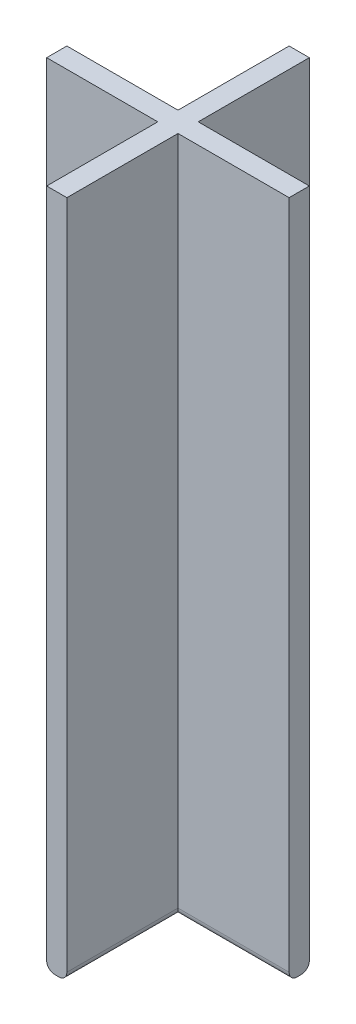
ISO-10303-21;
HEADER;
FILE_DESCRIPTION(('STEP AP214'),'2;1');
FILE_NAME('part.step','',(''),(''),'','','');
FILE_SCHEMA(('AUTOMOTIVE_DESIGN { 1 0 10303 214 1 1 1 1 }'));
ENDSEC;
DATA;
#1=APPLICATION_CONTEXT('core data for automotive mechanical design processes');
#2=APPLICATION_PROTOCOL_DEFINITION('international standard','automotive_design',2000,#1);
#3=PRODUCT_CONTEXT('',#1,'mechanical');
#4=PRODUCT('Part','Part','',(#3));
#5=PRODUCT_RELATED_PRODUCT_CATEGORY('part','',(#4));
#6=PRODUCT_DEFINITION_FORMATION('','',#4);
#7=PRODUCT_DEFINITION_CONTEXT('part definition',#1,'design');
#8=PRODUCT_DEFINITION('design','',#6,#7);
#9=PRODUCT_DEFINITION_SHAPE('','',#8);
#10=(LENGTH_UNIT() NAMED_UNIT(*) SI_UNIT(.MILLI.,.METRE.));
#11=(NAMED_UNIT(*) PLANE_ANGLE_UNIT() SI_UNIT($,.RADIAN.));
#12=(NAMED_UNIT(*) SI_UNIT($,.STERADIAN.) SOLID_ANGLE_UNIT());
#13=UNCERTAINTY_MEASURE_WITH_UNIT(LENGTH_MEASURE(1.E-05),#10,'distance_accuracy_value','');
#14=(GEOMETRIC_REPRESENTATION_CONTEXT(3) GLOBAL_UNCERTAINTY_ASSIGNED_CONTEXT((#13)) GLOBAL_UNIT_ASSIGNED_CONTEXT((#10,
#11,#12)) REPRESENTATION_CONTEXT('',''));
#15=CARTESIAN_POINT('',(0.,0.,0.));
#16=DIRECTION('',(0.,0.,1.));
#17=DIRECTION('',(1.,0.,0.));
#18=AXIS2_PLACEMENT_3D('',#15,#16,#17);
#19=CARTESIAN_POINT('',(-15.,84.,1.25));
#20=DIRECTION('',(0.,0.,-1.));
#21=DIRECTION('',(-1.,0.,0.));
#22=AXIS2_PLACEMENT_3D('',#19,#20,#21);
#23=PLANE('',#22);
#24=DIRECTION('',(0.,-1.,0.));
#25=VECTOR('',#24,1.);
#26=CARTESIAN_POINT('',(-15.,84.,1.25));
#27=LINE('',#26,#25);
#28=CARTESIAN_POINT('',(-15.,84.,1.25));
#29=VERTEX_POINT('',#28);
#30=CARTESIAN_POINT('',(-15.,1.00000000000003,1.25));
#31=VERTEX_POINT('',#30);
#32=EDGE_CURVE('E277',#29,#31,#27,.T.);
#33=ORIENTED_EDGE('',*,*,#32,.T.);
#34=DIRECTION('',(1.,0.,0.));
#35=VECTOR('',#34,1.);
#36=CARTESIAN_POINT('',(-1.25,1.,1.25));
#37=LINE('',#36,#35);
#38=CARTESIAN_POINT('',(-1.25,1.,1.25));
#39=VERTEX_POINT('',#38);
#40=EDGE_CURVE('E11',#31,#39,#37,.T.);
#41=ORIENTED_EDGE('',*,*,#40,.T.);
#42=DIRECTION('',(0.,-1.,0.));
#43=VECTOR('',#42,1.);
#44=CARTESIAN_POINT('',(-1.25,84.,1.25));
#45=LINE('',#44,#43);
#46=CARTESIAN_POINT('',(-1.25,84.,1.25));
#47=VERTEX_POINT('',#46);
#48=EDGE_CURVE('E265',#47,#39,#45,.T.);
#49=ORIENTED_EDGE('',*,*,#48,.F.);
#50=DIRECTION('',(1.,0.,0.));
#51=VECTOR('',#50,1.);
#52=CARTESIAN_POINT('',(-15.,84.,1.25));
#53=LINE('',#52,#51);
#54=EDGE_CURVE('E182',#29,#47,#53,.T.);
#55=ORIENTED_EDGE('',*,*,#54,.F.);
#56=EDGE_LOOP('',(#33,#41,#49,#55));
#57=FACE_BOUND('',#56,.T.);
#58=ADVANCED_FACE('F43',(#57),#23,.F.);
#59=CARTESIAN_POINT('',(0.,84.,-1.25));
#60=DIRECTION('',(0.,0.,1.));
#61=DIRECTION('',(1.,0.,0.));
#62=AXIS2_PLACEMENT_3D('',#59,#60,#61);
#63=PLANE('',#62);
#64=DIRECTION('',(0.,1.,0.));
#65=VECTOR('',#64,1.);
#66=CARTESIAN_POINT('',(-1.25,84.,-1.25));
#67=LINE('',#66,#65);
#68=CARTESIAN_POINT('',(-1.25,1.,-1.25));
#69=VERTEX_POINT('',#68);
#70=CARTESIAN_POINT('',(-1.25,84.,-1.25));
#71=VERTEX_POINT('',#70);
#72=EDGE_CURVE('E262',#69,#71,#67,.T.);
#73=ORIENTED_EDGE('',*,*,#72,.F.);
#74=DIRECTION('',(-1.,0.,0.));
#75=VECTOR('',#74,1.);
#76=CARTESIAN_POINT('',(-15.,1.,-1.25));
#77=LINE('',#76,#75);
#78=CARTESIAN_POINT('',(-15.,1.00000000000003,-1.25));
#79=VERTEX_POINT('',#78);
#80=EDGE_CURVE('E69',#69,#79,#77,.T.);
#81=ORIENTED_EDGE('',*,*,#80,.T.);
#82=DIRECTION('',(0.,-1.,0.));
#83=VECTOR('',#82,1.);
#84=CARTESIAN_POINT('',(-15.,84.,-1.25));
#85=LINE('',#84,#83);
#86=CARTESIAN_POINT('',(-15.,84.,-1.25));
#87=VERTEX_POINT('',#86);
#88=EDGE_CURVE('E282',#87,#79,#85,.T.);
#89=ORIENTED_EDGE('',*,*,#88,.F.);
#90=DIRECTION('',(-1.,0.,0.));
#91=VECTOR('',#90,1.);
#92=CARTESIAN_POINT('',(0.,84.,-1.25));
#93=LINE('',#92,#91);
#94=EDGE_CURVE('E271',#71,#87,#93,.T.);
#95=ORIENTED_EDGE('',*,*,#94,.F.);
#96=EDGE_LOOP('',(#73,#81,#89,#95));
#97=FACE_BOUND('',#96,.T.);
#98=ADVANCED_FACE('F420',(#97),#63,.F.);
#99=CARTESIAN_POINT('',(-15.,84.,-1.25));
#100=DIRECTION('',(1.,0.,0.));
#101=DIRECTION('',(0.,0.,-1.));
#102=AXIS2_PLACEMENT_3D('',#99,#100,#101);
#103=PLANE('',#102);
#104=ORIENTED_EDGE('',*,*,#88,.T.);
#105=CARTESIAN_POINT('',(-15.,1.,-0.25));
#106=DIRECTION('',(1.,0.,0.));
#107=DIRECTION('',(0.,0.,-1.));
#108=AXIS2_PLACEMENT_3D('',#105,#106,#107);
#109=CIRCLE('',#108,1.);
#110=CARTESIAN_POINT('',(-15.,0.,-0.25));
#111=VERTEX_POINT('',#110);
#112=EDGE_CURVE('E53',#79,#111,#109,.F.);
#113=ORIENTED_EDGE('',*,*,#112,.T.);
#114=DIRECTION('',(0.,0.,1.));
#115=VECTOR('',#114,1.);
#116=CARTESIAN_POINT('',(-15.,0.,-1.25));
#117=LINE('',#116,#115);
#118=CARTESIAN_POINT('',(-15.,0.,0.25));
#119=VERTEX_POINT('',#118);
#120=EDGE_CURVE('E268',#111,#119,#117,.T.);
#121=ORIENTED_EDGE('',*,*,#120,.T.);
#122=CARTESIAN_POINT('',(-15.,1.,0.25));
#123=DIRECTION('',(1.,0.,0.));
#124=DIRECTION('',(0.,0.,-1.));
#125=AXIS2_PLACEMENT_3D('',#122,#123,#124);
#126=CIRCLE('',#125,1.);
#127=EDGE_CURVE('E61',#119,#31,#126,.F.);
#128=ORIENTED_EDGE('',*,*,#127,.T.);
#129=ORIENTED_EDGE('',*,*,#32,.F.);
#130=DIRECTION('',(0.,0.,1.));
#131=VECTOR('',#130,1.);
#132=CARTESIAN_POINT('',(-15.,84.,-1.25));
#133=LINE('',#132,#131);
#134=EDGE_CURVE('E274',#87,#29,#133,.T.);
#135=ORIENTED_EDGE('',*,*,#134,.F.);
#136=EDGE_LOOP('',(#104,#113,#121,#128,#129,#135));
#137=FACE_BOUND('',#136,.T.);
#138=ADVANCED_FACE('F422',(#137),#103,.F.);
#139=CARTESIAN_POINT('',(0.,84.,0.));
#140=DIRECTION('',(0.,-1.,0.));
#141=DIRECTION('',(0.,0.,-1.));
#142=AXIS2_PLACEMENT_3D('',#139,#140,#141);
#143=PLANE('',#142);
#144=ORIENTED_EDGE('',*,*,#54,.T.);
#145=DIRECTION('',(0.,0.,1.));
#146=VECTOR('',#145,1.);
#147=CARTESIAN_POINT('',(-1.24999999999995,84.,-15.));
#148=LINE('',#147,#146);
#149=CARTESIAN_POINT('',(-1.25000000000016,84.,15.));
#150=VERTEX_POINT('',#149);
#151=EDGE_CURVE('E174',#47,#150,#148,.T.);
#152=ORIENTED_EDGE('',*,*,#151,.T.);
#153=DIRECTION('',(1.,0.,0.));
#154=VECTOR('',#153,1.);
#155=CARTESIAN_POINT('',(-1.25000000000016,84.,15.));
#156=LINE('',#155,#154);
#157=CARTESIAN_POINT('',(1.24999999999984,84.,15.));
#158=VERTEX_POINT('',#157);
#159=EDGE_CURVE('E179',#150,#158,#156,.T.);
#160=ORIENTED_EDGE('',*,*,#159,.T.);
#161=DIRECTION('',(0.,0.,-1.));
#162=VECTOR('',#161,1.);
#163=CARTESIAN_POINT('',(1.24999999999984,84.,15.));
#164=LINE('',#163,#162);
#165=CARTESIAN_POINT('',(1.24999999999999,84.,1.25));
#166=VERTEX_POINT('',#165);
#167=EDGE_CURVE('E204',#158,#166,#164,.T.);
#168=ORIENTED_EDGE('',*,*,#167,.T.);
#169=DIRECTION('',(1.,0.,0.));
#170=VECTOR('',#169,1.);
#171=CARTESIAN_POINT('',(0.,84.,1.25));
#172=LINE('',#171,#170);
#173=CARTESIAN_POINT('',(15.,84.,1.25));
#174=VERTEX_POINT('',#173);
#175=EDGE_CURVE('E223',#166,#174,#172,.T.);
#176=ORIENTED_EDGE('',*,*,#175,.T.);
#177=DIRECTION('',(0.,0.,-1.));
#178=VECTOR('',#177,1.);
#179=CARTESIAN_POINT('',(15.,84.,1.25));
#180=LINE('',#179,#178);
#181=CARTESIAN_POINT('',(15.,84.,-1.25));
#182=VERTEX_POINT('',#181);
#183=EDGE_CURVE('E226',#174,#182,#180,.T.);
#184=ORIENTED_EDGE('',*,*,#183,.T.);
#185=DIRECTION('',(-1.,0.,0.));
#186=VECTOR('',#185,1.);
#187=CARTESIAN_POINT('',(15.,84.,-1.25));
#188=LINE('',#187,#186);
#189=CARTESIAN_POINT('',(1.25,84.,-1.25));
#190=VERTEX_POINT('',#189);
#191=EDGE_CURVE('E219',#182,#190,#188,.T.);
#192=ORIENTED_EDGE('',*,*,#191,.T.);
#193=DIRECTION('',(0.,0.,-1.));
#194=VECTOR('',#193,1.);
#195=CARTESIAN_POINT('',(1.25,84.,0.));
#196=LINE('',#195,#194);
#197=CARTESIAN_POINT('',(1.25000000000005,84.,-15.));
#198=VERTEX_POINT('',#197);
#199=EDGE_CURVE('E245',#190,#198,#196,.T.);
#200=ORIENTED_EDGE('',*,*,#199,.T.);
#201=DIRECTION('',(-1.,0.,0.));
#202=VECTOR('',#201,1.);
#203=CARTESIAN_POINT('',(1.25000000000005,84.,-15.));
#204=LINE('',#203,#202);
#205=CARTESIAN_POINT('',(-1.24999999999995,84.,-15.));
#206=VERTEX_POINT('',#205);
#207=EDGE_CURVE('E248',#198,#206,#204,.T.);
#208=ORIENTED_EDGE('',*,*,#207,.T.);
#209=EDGE_CURVE('E186',#206,#71,#148,.T.);
#210=ORIENTED_EDGE('',*,*,#209,.T.);
#211=ORIENTED_EDGE('',*,*,#94,.T.);
#212=ORIENTED_EDGE('',*,*,#134,.T.);
#213=EDGE_LOOP('',(#144,#152,#160,#168,#176,#184,#192,#200,#208,#210,#211,#212));
#214=FACE_BOUND('',#213,.T.);
#215=ADVANCED_FACE('F176',(#214),#143,.F.);
#216=CARTESIAN_POINT('',(0.,0.,0.));
#217=DIRECTION('',(0.,-1.,0.));
#218=DIRECTION('',(0.,0.,-1.));
#219=AXIS2_PLACEMENT_3D('',#216,#217,#218);
#220=PLANE('',#219);
#221=DIRECTION('',(-1.,0.,0.));
#222=VECTOR('',#221,1.);
#223=CARTESIAN_POINT('',(1.25000000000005,0.,-15.));
#224=LINE('',#223,#222);
#225=CARTESIAN_POINT('',(0.250000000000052,0.,-15.));
#226=VERTEX_POINT('',#225);
#227=CARTESIAN_POINT('',(-0.249999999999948,0.,-15.));
#228=VERTEX_POINT('',#227);
#229=EDGE_CURVE('E187',#226,#228,#224,.T.);
#230=ORIENTED_EDGE('',*,*,#229,.F.);
#231=DIRECTION('',(0.,0.,-1.));
#232=VECTOR('',#231,1.);
#233=CARTESIAN_POINT('',(0.250000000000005,0.,-1.25));
#234=LINE('',#233,#232);
#235=CARTESIAN_POINT('',(0.250000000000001,0.,-0.250000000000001));
#236=VERTEX_POINT('',#235);
#237=EDGE_CURVE('E314',#226,#236,#234,.F.);
#238=ORIENTED_EDGE('',*,*,#237,.T.);
#239=DIRECTION('',(-1.,0.,0.));
#240=VECTOR('',#239,1.);
#241=CARTESIAN_POINT('',(15.,0.,-0.25));
#242=LINE('',#241,#240);
#243=CARTESIAN_POINT('',(15.,0.,-0.25));
#244=VERTEX_POINT('',#243);
#245=EDGE_CURVE('E311',#236,#244,#242,.F.);
#246=ORIENTED_EDGE('',*,*,#245,.T.);
#247=DIRECTION('',(0.,0.,-1.));
#248=VECTOR('',#247,1.);
#249=CARTESIAN_POINT('',(15.,0.,1.25));
#250=LINE('',#249,#248);
#251=CARTESIAN_POINT('',(15.,0.,0.25));
#252=VERTEX_POINT('',#251);
#253=EDGE_CURVE('E218',#252,#244,#250,.T.);
#254=ORIENTED_EDGE('',*,*,#253,.F.);
#255=DIRECTION('',(1.,0.,0.));
#256=VECTOR('',#255,1.);
#257=CARTESIAN_POINT('',(1.24999999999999,0.,0.250000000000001));
#258=LINE('',#257,#256);
#259=CARTESIAN_POINT('',(0.249999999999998,0.,0.250000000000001));
#260=VERTEX_POINT('',#259);
#261=EDGE_CURVE('E305',#252,#260,#258,.F.);
#262=ORIENTED_EDGE('',*,*,#261,.T.);
#263=DIRECTION('',(0.,0.,-1.));
#264=VECTOR('',#263,1.);
#265=CARTESIAN_POINT('',(0.249999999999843,0.,15.));
#266=LINE('',#265,#264);
#267=CARTESIAN_POINT('',(0.249999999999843,0.,15.));
#268=VERTEX_POINT('',#267);
#269=EDGE_CURVE('E308',#260,#268,#266,.F.);
#270=ORIENTED_EDGE('',*,*,#269,.T.);
#271=DIRECTION('',(1.,0.,0.));
#272=VECTOR('',#271,1.);
#273=CARTESIAN_POINT('',(-1.25000000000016,0.,15.));
#274=LINE('',#273,#272);
#275=CARTESIAN_POINT('',(-0.250000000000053,0.,15.));
#276=VERTEX_POINT('',#275);
#277=EDGE_CURVE('E209',#276,#268,#274,.T.);
#278=ORIENTED_EDGE('',*,*,#277,.F.);
#279=DIRECTION('',(0.,0.,1.));
#280=VECTOR('',#279,1.);
#281=CARTESIAN_POINT('',(-0.250000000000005,0.,1.25));
#282=LINE('',#281,#280);
#283=CARTESIAN_POINT('',(-0.250000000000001,0.,0.250000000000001));
#284=VERTEX_POINT('',#283);
#285=EDGE_CURVE('E296',#276,#284,#282,.F.);
#286=ORIENTED_EDGE('',*,*,#285,.T.);
#287=DIRECTION('',(1.,0.,0.));
#288=VECTOR('',#287,1.);
#289=CARTESIAN_POINT('',(-15.,0.,0.25));
#290=LINE('',#289,#288);
#291=EDGE_CURVE('E293',#284,#119,#290,.F.);
#292=ORIENTED_EDGE('',*,*,#291,.T.);
#293=ORIENTED_EDGE('',*,*,#120,.F.);
#294=DIRECTION('',(-1.,0.,0.));
#295=VECTOR('',#294,1.);
#296=CARTESIAN_POINT('',(-1.25,0.,-0.250000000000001));
#297=LINE('',#296,#295);
#298=CARTESIAN_POINT('',(-0.25,0.,-0.250000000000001));
#299=VERTEX_POINT('',#298);
#300=EDGE_CURVE('E299',#111,#299,#297,.F.);
#301=ORIENTED_EDGE('',*,*,#300,.T.);
#302=DIRECTION('',(0.,0.,1.));
#303=VECTOR('',#302,1.);
#304=CARTESIAN_POINT('',(-0.249999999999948,0.,-15.));
#305=LINE('',#304,#303);
#306=EDGE_CURVE('E302',#299,#228,#305,.F.);
#307=ORIENTED_EDGE('',*,*,#306,.T.);
#308=EDGE_LOOP('',(#230,#238,#246,#254,#262,#270,#278,#286,#292,#293,#301,#307));
#309=FACE_BOUND('',#308,.T.);
#310=ADVANCED_FACE('F378',(#309),#220,.T.);
#311=CARTESIAN_POINT('',(-1.24999999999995,84.,-15.));
#312=DIRECTION('',(1.,0.,0.));
#313=DIRECTION('',(0.,0.,-1.));
#314=AXIS2_PLACEMENT_3D('',#311,#312,#313);
#315=PLANE('',#314);
#316=ORIENTED_EDGE('',*,*,#48,.T.);
#317=DIRECTION('',(0.,0.,1.));
#318=VECTOR('',#317,1.);
#319=CARTESIAN_POINT('',(-1.25000000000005,1.,15.));
#320=LINE('',#319,#318);
#321=CARTESIAN_POINT('',(-1.25000000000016,1.00000000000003,15.));
#322=VERTEX_POINT('',#321);
#323=EDGE_CURVE('E194',#39,#322,#320,.T.);
#324=ORIENTED_EDGE('',*,*,#323,.T.);
#325=DIRECTION('',(0.,-1.,0.));
#326=VECTOR('',#325,1.);
#327=CARTESIAN_POINT('',(-1.25000000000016,84.,15.));
#328=LINE('',#327,#326);
#329=EDGE_CURVE('E191',#150,#322,#328,.T.);
#330=ORIENTED_EDGE('',*,*,#329,.F.);
#331=ORIENTED_EDGE('',*,*,#151,.F.);
#332=EDGE_LOOP('',(#316,#324,#330,#331));
#333=FACE_BOUND('',#332,.T.);
#334=ADVANCED_FACE('F192',(#333),#315,.F.);
#335=DIRECTION('',(0.,-1.,0.));
#336=VECTOR('',#335,1.);
#337=CARTESIAN_POINT('',(-1.24999999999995,84.,-15.));
#338=LINE('',#337,#336);
#339=CARTESIAN_POINT('',(-1.24999999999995,1.00000000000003,-15.));
#340=VERTEX_POINT('',#339);
#341=EDGE_CURVE('E251',#206,#340,#338,.T.);
#342=ORIENTED_EDGE('',*,*,#341,.T.);
#343=DIRECTION('',(0.,0.,1.));
#344=VECTOR('',#343,1.);
#345=CARTESIAN_POINT('',(-1.25,1.,-1.25));
#346=LINE('',#345,#344);
#347=EDGE_CURVE('E321',#340,#69,#346,.T.);
#348=ORIENTED_EDGE('',*,*,#347,.T.);
#349=ORIENTED_EDGE('',*,*,#72,.T.);
#350=ORIENTED_EDGE('',*,*,#209,.F.);
#351=EDGE_LOOP('',(#342,#348,#349,#350));
#352=FACE_BOUND('',#351,.T.);
#353=ADVANCED_FACE('F417',(#352),#315,.F.);
#354=CARTESIAN_POINT('',(1.25,84.,0.));
#355=DIRECTION('',(-1.,0.,0.));
#356=DIRECTION('',(0.,0.,1.));
#357=AXIS2_PLACEMENT_3D('',#354,#355,#356);
#358=PLANE('',#357);
#359=DIRECTION('',(0.,1.,0.));
#360=VECTOR('',#359,1.);
#361=CARTESIAN_POINT('',(1.25,84.,-1.25));
#362=LINE('',#361,#360);
#363=CARTESIAN_POINT('',(1.25,1.,-1.25));
#364=VERTEX_POINT('',#363);
#365=EDGE_CURVE('E240',#364,#190,#362,.T.);
#366=ORIENTED_EDGE('',*,*,#365,.F.);
#367=DIRECTION('',(0.,0.,-1.));
#368=VECTOR('',#367,1.);
#369=CARTESIAN_POINT('',(1.25000000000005,1.,-15.));
#370=LINE('',#369,#368);
#371=CARTESIAN_POINT('',(1.25000000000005,1.00000000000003,-15.));
#372=VERTEX_POINT('',#371);
#373=EDGE_CURVE('E331',#364,#372,#370,.T.);
#374=ORIENTED_EDGE('',*,*,#373,.T.);
#375=DIRECTION('',(0.,-1.,0.));
#376=VECTOR('',#375,1.);
#377=CARTESIAN_POINT('',(1.25000000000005,84.,-15.));
#378=LINE('',#377,#376);
#379=EDGE_CURVE('E258',#198,#372,#378,.T.);
#380=ORIENTED_EDGE('',*,*,#379,.F.);
#381=ORIENTED_EDGE('',*,*,#199,.F.);
#382=EDGE_LOOP('',(#366,#374,#380,#381));
#383=FACE_BOUND('',#382,.T.);
#384=ADVANCED_FACE('F411',(#383),#358,.F.);
#385=CARTESIAN_POINT('',(1.25000000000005,84.,-15.));
#386=DIRECTION('',(0.,0.,1.));
#387=DIRECTION('',(1.,0.,0.));
#388=AXIS2_PLACEMENT_3D('',#385,#386,#387);
#389=PLANE('',#388);
#390=ORIENTED_EDGE('',*,*,#229,.T.);
#391=CARTESIAN_POINT('',(-0.249999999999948,1.,-15.));
#392=DIRECTION('',(0.,0.,1.));
#393=DIRECTION('',(1.,0.,0.));
#394=AXIS2_PLACEMENT_3D('',#391,#392,#393);
#395=CIRCLE('',#394,1.);
#396=EDGE_CURVE('E328',#228,#340,#395,.F.);
#397=ORIENTED_EDGE('',*,*,#396,.T.);
#398=ORIENTED_EDGE('',*,*,#341,.F.);
#399=ORIENTED_EDGE('',*,*,#207,.F.);
#400=ORIENTED_EDGE('',*,*,#379,.T.);
#401=CARTESIAN_POINT('',(0.250000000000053,1.,-15.));
#402=DIRECTION('',(0.,0.,1.));
#403=DIRECTION('',(1.,0.,0.));
#404=AXIS2_PLACEMENT_3D('',#401,#402,#403);
#405=CIRCLE('',#404,1.);
#406=EDGE_CURVE('E325',#372,#226,#405,.F.);
#407=ORIENTED_EDGE('',*,*,#406,.T.);
#408=EDGE_LOOP('',(#390,#397,#398,#399,#400,#407));
#409=FACE_BOUND('',#408,.T.);
#410=ADVANCED_FACE('F413',(#409),#389,.F.);
#411=CARTESIAN_POINT('',(15.,84.,-1.25));
#412=DIRECTION('',(0.,0.,1.));
#413=DIRECTION('',(1.,0.,0.));
#414=AXIS2_PLACEMENT_3D('',#411,#412,#413);
#415=PLANE('',#414);
#416=DIRECTION('',(0.,-1.,0.));
#417=VECTOR('',#416,1.);
#418=CARTESIAN_POINT('',(15.,84.,-1.25));
#419=LINE('',#418,#417);
#420=CARTESIAN_POINT('',(15.,1.00000000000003,-1.25));
#421=VERTEX_POINT('',#420);
#422=EDGE_CURVE('E229',#182,#421,#419,.T.);
#423=ORIENTED_EDGE('',*,*,#422,.T.);
#424=DIRECTION('',(-1.,0.,0.));
#425=VECTOR('',#424,1.);
#426=CARTESIAN_POINT('',(1.25,1.,-1.25));
#427=LINE('',#426,#425);
#428=EDGE_CURVE('E335',#421,#364,#427,.T.);
#429=ORIENTED_EDGE('',*,*,#428,.T.);
#430=ORIENTED_EDGE('',*,*,#365,.T.);
#431=ORIENTED_EDGE('',*,*,#191,.F.);
#432=EDGE_LOOP('',(#423,#429,#430,#431));
#433=FACE_BOUND('',#432,.T.);
#434=ADVANCED_FACE('F404',(#433),#415,.F.);
#435=CARTESIAN_POINT('',(0.,84.,1.25));
#436=DIRECTION('',(0.,0.,-1.));
#437=DIRECTION('',(-1.,0.,0.));
#438=AXIS2_PLACEMENT_3D('',#435,#436,#437);
#439=PLANE('',#438);
#440=DIRECTION('',(0.,1.,0.));
#441=VECTOR('',#440,1.);
#442=CARTESIAN_POINT('',(1.24999999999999,84.,1.25));
#443=LINE('',#442,#441);
#444=CARTESIAN_POINT('',(1.24999999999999,1.,1.25));
#445=VERTEX_POINT('',#444);
#446=EDGE_CURVE('E197',#445,#166,#443,.T.);
#447=ORIENTED_EDGE('',*,*,#446,.F.);
#448=DIRECTION('',(1.,0.,0.));
#449=VECTOR('',#448,1.);
#450=CARTESIAN_POINT('',(15.,1.,1.25));
#451=LINE('',#450,#449);
#452=CARTESIAN_POINT('',(15.,1.00000000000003,1.25));
#453=VERTEX_POINT('',#452);
#454=EDGE_CURVE('E344',#445,#453,#451,.T.);
#455=ORIENTED_EDGE('',*,*,#454,.T.);
#456=DIRECTION('',(0.,-1.,0.));
#457=VECTOR('',#456,1.);
#458=CARTESIAN_POINT('',(15.,84.,1.25));
#459=LINE('',#458,#457);
#460=EDGE_CURVE('E236',#174,#453,#459,.T.);
#461=ORIENTED_EDGE('',*,*,#460,.F.);
#462=ORIENTED_EDGE('',*,*,#175,.F.);
#463=EDGE_LOOP('',(#447,#455,#461,#462));
#464=FACE_BOUND('',#463,.T.);
#465=ADVANCED_FACE('F401',(#464),#439,.F.);
#466=CARTESIAN_POINT('',(15.,84.,1.25));
#467=DIRECTION('',(-1.,0.,0.));
#468=DIRECTION('',(0.,0.,1.));
#469=AXIS2_PLACEMENT_3D('',#466,#467,#468);
#470=PLANE('',#469);
#471=ORIENTED_EDGE('',*,*,#253,.T.);
#472=CARTESIAN_POINT('',(15.,1.,-0.25));
#473=DIRECTION('',(-1.,0.,0.));
#474=DIRECTION('',(0.,0.,1.));
#475=AXIS2_PLACEMENT_3D('',#472,#473,#474);
#476=CIRCLE('',#475,1.);
#477=EDGE_CURVE('E341',#244,#421,#476,.F.);
#478=ORIENTED_EDGE('',*,*,#477,.T.);
#479=ORIENTED_EDGE('',*,*,#422,.F.);
#480=ORIENTED_EDGE('',*,*,#183,.F.);
#481=ORIENTED_EDGE('',*,*,#460,.T.);
#482=CARTESIAN_POINT('',(15.,1.,0.25));
#483=DIRECTION('',(-1.,0.,0.));
#484=DIRECTION('',(0.,0.,1.));
#485=AXIS2_PLACEMENT_3D('',#482,#483,#484);
#486=CIRCLE('',#485,1.);
#487=EDGE_CURVE('E338',#453,#252,#486,.F.);
#488=ORIENTED_EDGE('',*,*,#487,.T.);
#489=EDGE_LOOP('',(#471,#478,#479,#480,#481,#488));
#490=FACE_BOUND('',#489,.T.);
#491=ADVANCED_FACE('F381',(#490),#470,.F.);
#492=CARTESIAN_POINT('',(1.24999999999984,84.,15.));
#493=DIRECTION('',(-1.,0.,0.));
#494=DIRECTION('',(0.,0.,1.));
#495=AXIS2_PLACEMENT_3D('',#492,#493,#494);
#496=PLANE('',#495);
#497=DIRECTION('',(0.,-1.,0.));
#498=VECTOR('',#497,1.);
#499=CARTESIAN_POINT('',(1.24999999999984,84.,15.));
#500=LINE('',#499,#498);
#501=CARTESIAN_POINT('',(1.24999999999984,1.00000000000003,15.));
#502=VERTEX_POINT('',#501);
#503=EDGE_CURVE('E198',#158,#502,#500,.T.);
#504=ORIENTED_EDGE('',*,*,#503,.T.);
#505=DIRECTION('',(0.,0.,-1.));
#506=VECTOR('',#505,1.);
#507=CARTESIAN_POINT('',(1.24999999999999,1.,1.25));
#508=LINE('',#507,#506);
#509=EDGE_CURVE('E317',#502,#445,#508,.T.);
#510=ORIENTED_EDGE('',*,*,#509,.T.);
#511=ORIENTED_EDGE('',*,*,#446,.T.);
#512=ORIENTED_EDGE('',*,*,#167,.F.);
#513=EDGE_LOOP('',(#504,#510,#511,#512));
#514=FACE_BOUND('',#513,.T.);
#515=ADVANCED_FACE('F397',(#514),#496,.F.);
#516=CARTESIAN_POINT('',(-1.25000000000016,84.,15.));
#517=DIRECTION('',(0.,0.,-1.));
#518=DIRECTION('',(-1.,0.,0.));
#519=AXIS2_PLACEMENT_3D('',#516,#517,#518);
#520=PLANE('',#519);
#521=ORIENTED_EDGE('',*,*,#329,.T.);
#522=CARTESIAN_POINT('',(-0.250000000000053,1.,15.));
#523=DIRECTION('',(0.,0.,-1.));
#524=DIRECTION('',(-1.,0.,0.));
#525=AXIS2_PLACEMENT_3D('',#522,#523,#524);
#526=CIRCLE('',#525,1.);
#527=EDGE_CURVE('E290',#322,#276,#526,.F.);
#528=ORIENTED_EDGE('',*,*,#527,.T.);
#529=ORIENTED_EDGE('',*,*,#277,.T.);
#530=CARTESIAN_POINT('',(0.249999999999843,1.,15.));
#531=DIRECTION('',(0.,0.,-1.));
#532=DIRECTION('',(-1.,0.,0.));
#533=AXIS2_PLACEMENT_3D('',#530,#531,#532);
#534=CIRCLE('',#533,1.);
#535=EDGE_CURVE('E287',#268,#502,#534,.F.);
#536=ORIENTED_EDGE('',*,*,#535,.T.);
#537=ORIENTED_EDGE('',*,*,#503,.F.);
#538=ORIENTED_EDGE('',*,*,#159,.F.);
#539=EDGE_LOOP('',(#521,#528,#529,#536,#537,#538));
#540=FACE_BOUND('',#539,.T.);
#541=ADVANCED_FACE('F200',(#540),#520,.F.);
#542=CARTESIAN_POINT('',(-15.,1.,0.25));
#543=DIRECTION('',(-1.,0.,0.));
#544=DIRECTION('',(0.,0.,1.));
#545=AXIS2_PLACEMENT_3D('',#542,#543,#544);
#546=CYLINDRICAL_SURFACE('',#545,1.);
#547=ORIENTED_EDGE('',*,*,#127,.F.);
#548=ORIENTED_EDGE('',*,*,#291,.F.);
#549=CARTESIAN_POINT('',(-0.250000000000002,1.,0.25));
#550=DIRECTION('',(-0.707106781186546,0.,-0.707106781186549));
#551=DIRECTION('',(0.707106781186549,0.,-0.707106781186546));
#552=AXIS2_PLACEMENT_3D('',#549,#550,#551);
#553=ELLIPSE('',#552,1.4142135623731,1.);
#554=EDGE_CURVE('E214',#39,#284,#553,.F.);
#555=ORIENTED_EDGE('',*,*,#554,.F.);
#556=ORIENTED_EDGE('',*,*,#40,.F.);
#557=EDGE_LOOP('',(#547,#548,#555,#556));
#558=FACE_BOUND('',#557,.T.);
#559=ADVANCED_FACE('F428',(#558),#546,.T.);
#560=CARTESIAN_POINT('',(-0.249999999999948,1.,-15.));
#561=DIRECTION('',(0.,0.,-1.));
#562=DIRECTION('',(-1.,0.,0.));
#563=AXIS2_PLACEMENT_3D('',#560,#561,#562);
#564=CYLINDRICAL_SURFACE('',#563,1.);
#565=ORIENTED_EDGE('',*,*,#554,.T.);
#566=ORIENTED_EDGE('',*,*,#285,.F.);
#567=ORIENTED_EDGE('',*,*,#527,.F.);
#568=ORIENTED_EDGE('',*,*,#323,.F.);
#569=EDGE_LOOP('',(#565,#566,#567,#568));
#570=FACE_BOUND('',#569,.T.);
#571=ADVANCED_FACE('F431',(#570),#564,.T.);
#572=CARTESIAN_POINT('',(0.,1.,0.250000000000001));
#573=DIRECTION('',(-1.,0.,0.));
#574=DIRECTION('',(0.,0.,1.));
#575=AXIS2_PLACEMENT_3D('',#572,#573,#574);
#576=CYLINDRICAL_SURFACE('',#575,1.);
#577=ORIENTED_EDGE('',*,*,#487,.F.);
#578=ORIENTED_EDGE('',*,*,#454,.F.);
#579=CARTESIAN_POINT('',(0.249999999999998,1.,0.25));
#580=DIRECTION('',(-0.707106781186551,0.,0.707106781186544));
#581=DIRECTION('',(0.707106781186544,0.,0.707106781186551));
#582=AXIS2_PLACEMENT_3D('',#579,#580,#581);
#583=ELLIPSE('',#582,1.41421356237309,1.);
#584=EDGE_CURVE('E356',#260,#445,#583,.T.);
#585=ORIENTED_EDGE('',*,*,#584,.F.);
#586=ORIENTED_EDGE('',*,*,#261,.F.);
#587=EDGE_LOOP('',(#577,#578,#585,#586));
#588=FACE_BOUND('',#587,.T.);
#589=ADVANCED_FACE('F388',(#588),#576,.T.);
#590=CARTESIAN_POINT('',(0.249999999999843,1.,15.));
#591=DIRECTION('',(0.,0.,1.));
#592=DIRECTION('',(1.,0.,0.));
#593=AXIS2_PLACEMENT_3D('',#590,#591,#592);
#594=CYLINDRICAL_SURFACE('',#593,1.);
#595=ORIENTED_EDGE('',*,*,#535,.F.);
#596=ORIENTED_EDGE('',*,*,#269,.F.);
#597=ORIENTED_EDGE('',*,*,#584,.T.);
#598=ORIENTED_EDGE('',*,*,#509,.F.);
#599=EDGE_LOOP('',(#595,#596,#597,#598));
#600=FACE_BOUND('',#599,.T.);
#601=ADVANCED_FACE('F394',(#600),#594,.T.);
#602=CARTESIAN_POINT('',(0.,1.,-0.250000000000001));
#603=DIRECTION('',(1.,0.,0.));
#604=DIRECTION('',(0.,0.,-1.));
#605=AXIS2_PLACEMENT_3D('',#602,#603,#604);
#606=CYLINDRICAL_SURFACE('',#605,1.);
#607=ORIENTED_EDGE('',*,*,#112,.F.);
#608=ORIENTED_EDGE('',*,*,#80,.F.);
#609=CARTESIAN_POINT('',(-0.25,1.,-0.25));
#610=DIRECTION('',(0.707106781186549,0.,-0.707106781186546));
#611=DIRECTION('',(-0.707106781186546,0.,-0.707106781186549));
#612=AXIS2_PLACEMENT_3D('',#609,#610,#611);
#613=ELLIPSE('',#612,1.41421356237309,1.);
#614=EDGE_CURVE('E358',#299,#69,#613,.T.);
#615=ORIENTED_EDGE('',*,*,#614,.F.);
#616=ORIENTED_EDGE('',*,*,#300,.F.);
#617=EDGE_LOOP('',(#607,#608,#615,#616));
#618=FACE_BOUND('',#617,.T.);
#619=ADVANCED_FACE('F435',(#618),#606,.T.);
#620=CARTESIAN_POINT('',(-0.249999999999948,1.,-15.));
#621=DIRECTION('',(0.,0.,-1.));
#622=DIRECTION('',(-1.,0.,0.));
#623=AXIS2_PLACEMENT_3D('',#620,#621,#622);
#624=CYLINDRICAL_SURFACE('',#623,1.);
#625=ORIENTED_EDGE('',*,*,#396,.F.);
#626=ORIENTED_EDGE('',*,*,#306,.F.);
#627=ORIENTED_EDGE('',*,*,#614,.T.);
#628=ORIENTED_EDGE('',*,*,#347,.F.);
#629=EDGE_LOOP('',(#625,#626,#627,#628));
#630=FACE_BOUND('',#629,.T.);
#631=ADVANCED_FACE('F436',(#630),#624,.T.);
#632=CARTESIAN_POINT('',(15.,1.,-0.25));
#633=DIRECTION('',(1.,0.,0.));
#634=DIRECTION('',(0.,0.,-1.));
#635=AXIS2_PLACEMENT_3D('',#632,#633,#634);
#636=CYLINDRICAL_SURFACE('',#635,1.);
#637=ORIENTED_EDGE('',*,*,#477,.F.);
#638=ORIENTED_EDGE('',*,*,#245,.F.);
#639=CARTESIAN_POINT('',(0.250000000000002,1.,-0.250000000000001));
#640=DIRECTION('',(0.707106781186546,0.,0.707106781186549));
#641=DIRECTION('',(-0.707106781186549,0.,0.707106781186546));
#642=AXIS2_PLACEMENT_3D('',#639,#640,#641);
#643=ELLIPSE('',#642,1.4142135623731,1.);
#644=EDGE_CURVE('E47',#364,#236,#643,.F.);
#645=ORIENTED_EDGE('',*,*,#644,.F.);
#646=ORIENTED_EDGE('',*,*,#428,.F.);
#647=EDGE_LOOP('',(#637,#638,#645,#646));
#648=FACE_BOUND('',#647,.T.);
#649=ADVANCED_FACE('F45',(#648),#636,.T.);
#650=CARTESIAN_POINT('',(0.250000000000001,1.,0.));
#651=DIRECTION('',(0.,0.,1.));
#652=DIRECTION('',(1.,0.,0.));
#653=AXIS2_PLACEMENT_3D('',#650,#651,#652);
#654=CYLINDRICAL_SURFACE('',#653,1.);
#655=ORIENTED_EDGE('',*,*,#644,.T.);
#656=ORIENTED_EDGE('',*,*,#237,.F.);
#657=ORIENTED_EDGE('',*,*,#406,.F.);
#658=ORIENTED_EDGE('',*,*,#373,.F.);
#659=EDGE_LOOP('',(#655,#656,#657,#658));
#660=FACE_BOUND('',#659,.T.);
#661=ADVANCED_FACE('F370',(#660),#654,.T.);
#662=CLOSED_SHELL('',(#58,#98,#138,#215,#310,#334,#353,#384,#410,#434,#465,#491,#515,#541,#559,
#571,#589,#601,#619,#631,#649,#661));
#663=MANIFOLD_SOLID_BREP('B2',#662);
#664=ADVANCED_BREP_SHAPE_REPRESENTATION('',(#18,#663),#14);
#665=SHAPE_DEFINITION_REPRESENTATION(#9,#664);
ENDSEC;
END-ISO-10303-21;
